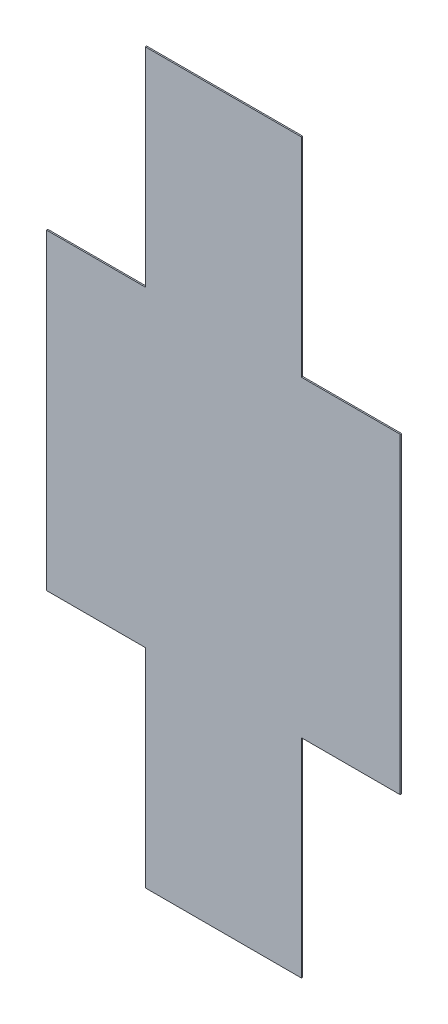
from build123d import *

# Parameters (mm, degrees)
SKETCH_1_W          = 76
SKETCH_1_H          = 70
EXTRUDE_1_DEPTH     = 0.13
CUT_EXTRUDE_1_DEPTH = 52.662528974


with BuildPart() as part:
    # Sketch 1 → Extrude 1 (new body)
    with BuildSketch(Plane.XY):
        Rectangle(SKETCH_1_W, SKETCH_1_H)
    extrude(amount=EXTRUDE_1_DEPTH)

    # Sketch 2 → Cut-Extrude 1 (cut, through all)
    with BuildSketch(Plane.XY.offset(0.13)):
        Polygon((-38, 35), (-7.5, 35), (-7.5, 15), (-17, 15), (-17, -15), (-7.5, -15), (-7.5, -35), (-38, -35), align=None)
        Polygon((17, 15), (7.5, 15), (7.5, 35), (38, 35), (38, -35), (7.5, -35), (7.5, -15), (17, -15), align=None)
    extrude(amount=-CUT_EXTRUDE_1_DEPTH, mode=Mode.SUBTRACT)


solid = part.part
